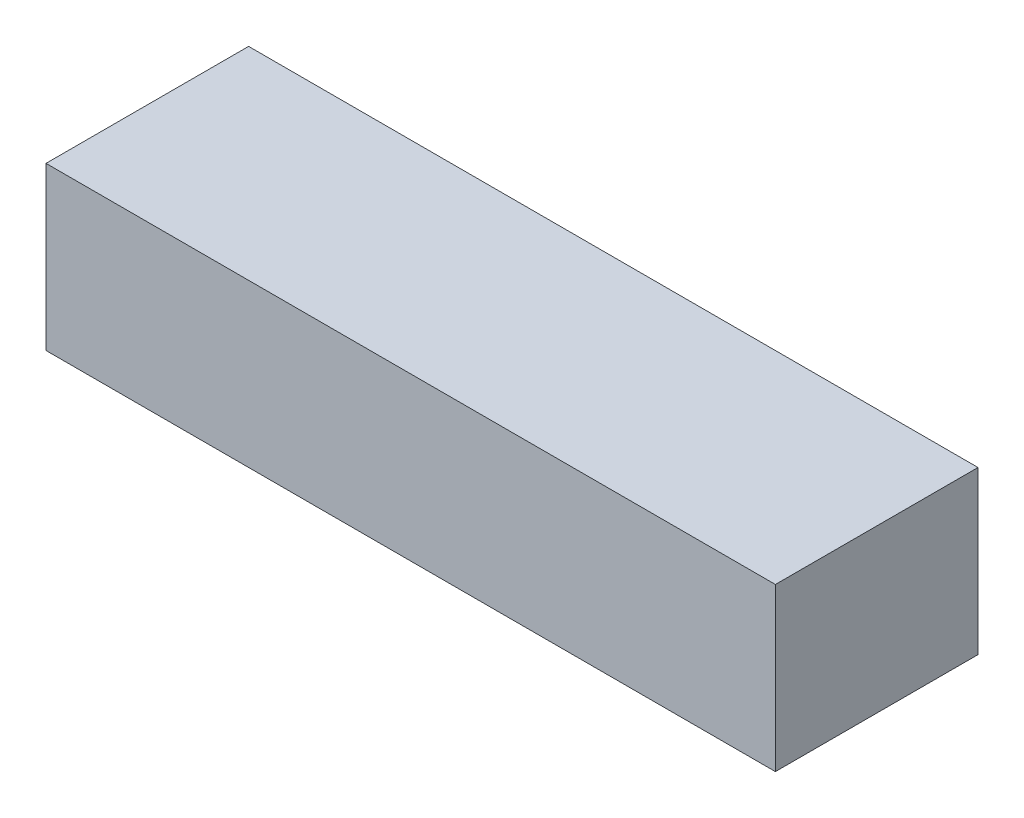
ISO-10303-21;
HEADER;
FILE_DESCRIPTION(('STEP AP214'),'2;1');
FILE_NAME('part.step','',(''),(''),'','','');
FILE_SCHEMA(('AUTOMOTIVE_DESIGN { 1 0 10303 214 1 1 1 1 }'));
ENDSEC;
DATA;
#1=APPLICATION_CONTEXT('core data for automotive mechanical design processes');
#2=APPLICATION_PROTOCOL_DEFINITION('international standard','automotive_design',2000,#1);
#3=PRODUCT_CONTEXT('',#1,'mechanical');
#4=PRODUCT('Part','Part','',(#3));
#5=PRODUCT_RELATED_PRODUCT_CATEGORY('part','',(#4));
#6=PRODUCT_DEFINITION_FORMATION('','',#4);
#7=PRODUCT_DEFINITION_CONTEXT('part definition',#1,'design');
#8=PRODUCT_DEFINITION('design','',#6,#7);
#9=PRODUCT_DEFINITION_SHAPE('','',#8);
#10=(LENGTH_UNIT() NAMED_UNIT(*) SI_UNIT(.MILLI.,.METRE.));
#11=(NAMED_UNIT(*) PLANE_ANGLE_UNIT() SI_UNIT($,.RADIAN.));
#12=(NAMED_UNIT(*) SI_UNIT($,.STERADIAN.) SOLID_ANGLE_UNIT());
#13=UNCERTAINTY_MEASURE_WITH_UNIT(LENGTH_MEASURE(1.E-05),#10,'distance_accuracy_value','');
#14=(GEOMETRIC_REPRESENTATION_CONTEXT(3) GLOBAL_UNCERTAINTY_ASSIGNED_CONTEXT((#13)) GLOBAL_UNIT_ASSIGNED_CONTEXT((#10,
#11,#12)) REPRESENTATION_CONTEXT('',''));
#15=CARTESIAN_POINT('',(0.,0.,0.));
#16=DIRECTION('',(0.,0.,1.));
#17=DIRECTION('',(1.,0.,0.));
#18=AXIS2_PLACEMENT_3D('',#15,#16,#17);
#19=CARTESIAN_POINT('',(0.,0.,5.));
#20=DIRECTION('',(1.,0.,0.));
#21=DIRECTION('',(0.,0.,-1.));
#22=AXIS2_PLACEMENT_3D('',#19,#20,#21);
#23=PLANE('',#22);
#24=DIRECTION('',(0.,-1.,0.));
#25=VECTOR('',#24,1.);
#26=CARTESIAN_POINT('',(0.,0.,0.));
#27=LINE('',#26,#25);
#28=CARTESIAN_POINT('',(0.,4.,0.));
#29=VERTEX_POINT('',#28);
#30=CARTESIAN_POINT('',(0.,0.,0.));
#31=VERTEX_POINT('',#30);
#32=EDGE_CURVE('E70',#29,#31,#27,.T.);
#33=ORIENTED_EDGE('',*,*,#32,.T.);
#34=DIRECTION('',(0.,0.,-1.));
#35=VECTOR('',#34,1.);
#36=CARTESIAN_POINT('',(0.,0.,5.));
#37=LINE('',#36,#35);
#38=CARTESIAN_POINT('',(0.,0.,5.));
#39=VERTEX_POINT('',#38);
#40=EDGE_CURVE('E11',#39,#31,#37,.T.);
#41=ORIENTED_EDGE('',*,*,#40,.F.);
#42=DIRECTION('',(0.,-1.,0.));
#43=VECTOR('',#42,1.);
#44=CARTESIAN_POINT('',(0.,0.,5.));
#45=LINE('',#44,#43);
#46=CARTESIAN_POINT('',(0.,4.,5.));
#47=VERTEX_POINT('',#46);
#48=EDGE_CURVE('E88',#47,#39,#45,.T.);
#49=ORIENTED_EDGE('',*,*,#48,.F.);
#50=DIRECTION('',(0.,0.,-1.));
#51=VECTOR('',#50,1.);
#52=CARTESIAN_POINT('',(0.,4.,5.));
#53=LINE('',#52,#51);
#54=EDGE_CURVE('E82',#47,#29,#53,.T.);
#55=ORIENTED_EDGE('',*,*,#54,.T.);
#56=EDGE_LOOP('',(#33,#41,#49,#55));
#57=FACE_BOUND('',#56,.T.);
#58=ADVANCED_FACE('F26',(#57),#23,.F.);
#59=CARTESIAN_POINT('',(0.,0.,5.));
#60=DIRECTION('',(0.,1.,0.));
#61=DIRECTION('',(0.,0.,1.));
#62=AXIS2_PLACEMENT_3D('',#59,#60,#61);
#63=PLANE('',#62);
#64=DIRECTION('',(1.,0.,0.));
#65=VECTOR('',#64,1.);
#66=CARTESIAN_POINT('',(0.,0.,0.));
#67=LINE('',#66,#65);
#68=CARTESIAN_POINT('',(18.,0.,0.));
#69=VERTEX_POINT('',#68);
#70=EDGE_CURVE('E66',#31,#69,#67,.T.);
#71=ORIENTED_EDGE('',*,*,#70,.T.);
#72=DIRECTION('',(0.,0.,-1.));
#73=VECTOR('',#72,1.);
#74=CARTESIAN_POINT('',(18.,0.,5.));
#75=LINE('',#74,#73);
#76=CARTESIAN_POINT('',(18.,0.,5.));
#77=VERTEX_POINT('',#76);
#78=EDGE_CURVE('E33',#77,#69,#75,.T.);
#79=ORIENTED_EDGE('',*,*,#78,.F.);
#80=DIRECTION('',(1.,0.,0.));
#81=VECTOR('',#80,1.);
#82=CARTESIAN_POINT('',(0.,0.,5.));
#83=LINE('',#82,#81);
#84=EDGE_CURVE('E78',#39,#77,#83,.T.);
#85=ORIENTED_EDGE('',*,*,#84,.F.);
#86=ORIENTED_EDGE('',*,*,#40,.T.);
#87=EDGE_LOOP('',(#71,#79,#85,#86));
#88=FACE_BOUND('',#87,.T.);
#89=ADVANCED_FACE('F77',(#88),#63,.F.);
#90=CARTESIAN_POINT('',(18.,0.,5.));
#91=DIRECTION('',(-1.,0.,0.));
#92=DIRECTION('',(0.,0.,1.));
#93=AXIS2_PLACEMENT_3D('',#90,#91,#92);
#94=PLANE('',#93);
#95=DIRECTION('',(0.,1.,0.));
#96=VECTOR('',#95,1.);
#97=CARTESIAN_POINT('',(18.,0.,0.));
#98=LINE('',#97,#96);
#99=CARTESIAN_POINT('',(18.,4.,0.));
#100=VERTEX_POINT('',#99);
#101=EDGE_CURVE('E71',#69,#100,#98,.T.);
#102=ORIENTED_EDGE('',*,*,#101,.T.);
#103=DIRECTION('',(0.,0.,-1.));
#104=VECTOR('',#103,1.);
#105=CARTESIAN_POINT('',(18.,4.,5.));
#106=LINE('',#105,#104);
#107=CARTESIAN_POINT('',(18.,4.,5.));
#108=VERTEX_POINT('',#107);
#109=EDGE_CURVE('E94',#108,#100,#106,.T.);
#110=ORIENTED_EDGE('',*,*,#109,.F.);
#111=DIRECTION('',(0.,1.,0.));
#112=VECTOR('',#111,1.);
#113=CARTESIAN_POINT('',(18.,0.,5.));
#114=LINE('',#113,#112);
#115=EDGE_CURVE('E45',#77,#108,#114,.T.);
#116=ORIENTED_EDGE('',*,*,#115,.F.);
#117=ORIENTED_EDGE('',*,*,#78,.T.);
#118=EDGE_LOOP('',(#102,#110,#116,#117));
#119=FACE_BOUND('',#118,.T.);
#120=ADVANCED_FACE('F97',(#119),#94,.F.);
#121=CARTESIAN_POINT('',(0.,4.,5.));
#122=DIRECTION('',(0.,-1.,0.));
#123=DIRECTION('',(0.,0.,-1.));
#124=AXIS2_PLACEMENT_3D('',#121,#122,#123);
#125=PLANE('',#124);
#126=DIRECTION('',(-1.,0.,0.));
#127=VECTOR('',#126,1.);
#128=CARTESIAN_POINT('',(0.,4.,0.));
#129=LINE('',#128,#127);
#130=EDGE_CURVE('E86',#100,#29,#129,.T.);
#131=ORIENTED_EDGE('',*,*,#130,.T.);
#132=ORIENTED_EDGE('',*,*,#54,.F.);
#133=DIRECTION('',(-1.,0.,0.));
#134=VECTOR('',#133,1.);
#135=CARTESIAN_POINT('',(0.,4.,5.));
#136=LINE('',#135,#134);
#137=EDGE_CURVE('E40',#108,#47,#136,.T.);
#138=ORIENTED_EDGE('',*,*,#137,.F.);
#139=ORIENTED_EDGE('',*,*,#109,.T.);
#140=EDGE_LOOP('',(#131,#132,#138,#139));
#141=FACE_BOUND('',#140,.T.);
#142=ADVANCED_FACE('F99',(#141),#125,.F.);
#143=CARTESIAN_POINT('',(0.,4.,5.));
#144=DIRECTION('',(0.,0.,-1.));
#145=DIRECTION('',(-1.,0.,0.));
#146=AXIS2_PLACEMENT_3D('',#143,#144,#145);
#147=PLANE('',#146);
#148=ORIENTED_EDGE('',*,*,#48,.T.);
#149=ORIENTED_EDGE('',*,*,#84,.T.);
#150=ORIENTED_EDGE('',*,*,#115,.T.);
#151=ORIENTED_EDGE('',*,*,#137,.T.);
#152=EDGE_LOOP('',(#148,#149,#150,#151));
#153=FACE_BOUND('',#152,.T.);
#154=ADVANCED_FACE('F100',(#153),#147,.F.);
#155=CARTESIAN_POINT('',(0.,4.,0.));
#156=DIRECTION('',(0.,0.,-1.));
#157=DIRECTION('',(-1.,0.,0.));
#158=AXIS2_PLACEMENT_3D('',#155,#156,#157);
#159=PLANE('',#158);
#160=ORIENTED_EDGE('',*,*,#32,.F.);
#161=ORIENTED_EDGE('',*,*,#130,.F.);
#162=ORIENTED_EDGE('',*,*,#101,.F.);
#163=ORIENTED_EDGE('',*,*,#70,.F.);
#164=EDGE_LOOP('',(#160,#161,#162,#163));
#165=FACE_BOUND('',#164,.T.);
#166=ADVANCED_FACE('F67',(#165),#159,.T.);
#167=CLOSED_SHELL('',(#58,#89,#120,#142,#154,#166));
#168=MANIFOLD_SOLID_BREP('B2',#167);
#169=ADVANCED_BREP_SHAPE_REPRESENTATION('',(#18,#168),#14);
#170=SHAPE_DEFINITION_REPRESENTATION(#9,#169);
ENDSEC;
END-ISO-10303-21;
